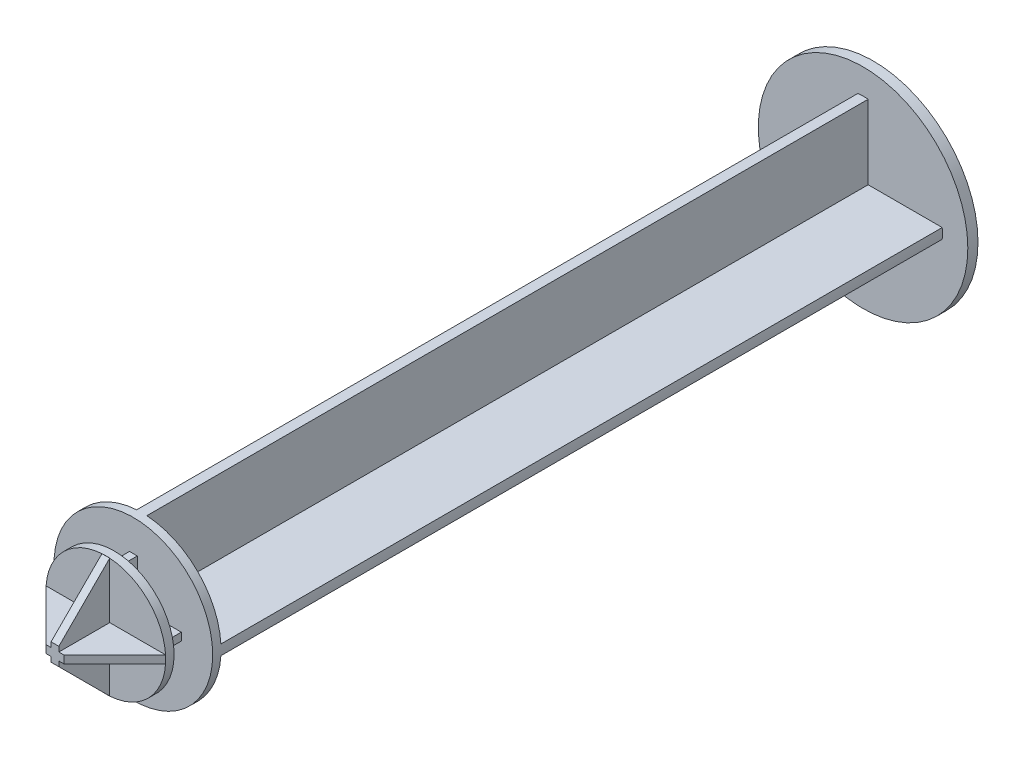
ISO-10303-21;
HEADER;
FILE_DESCRIPTION(('STEP AP214'),'2;1');
FILE_NAME('part.step','',(''),(''),'','','');
FILE_SCHEMA(('AUTOMOTIVE_DESIGN { 1 0 10303 214 1 1 1 1 }'));
ENDSEC;
DATA;
#1=APPLICATION_CONTEXT('core data for automotive mechanical design processes');
#2=APPLICATION_PROTOCOL_DEFINITION('international standard','automotive_design',2000,#1);
#3=PRODUCT_CONTEXT('',#1,'mechanical');
#4=PRODUCT('Part','Part','',(#3));
#5=PRODUCT_RELATED_PRODUCT_CATEGORY('part','',(#4));
#6=PRODUCT_DEFINITION_FORMATION('','',#4);
#7=PRODUCT_DEFINITION_CONTEXT('part definition',#1,'design');
#8=PRODUCT_DEFINITION('design','',#6,#7);
#9=PRODUCT_DEFINITION_SHAPE('','',#8);
#10=(LENGTH_UNIT() NAMED_UNIT(*) SI_UNIT(.MILLI.,.METRE.));
#11=(NAMED_UNIT(*) PLANE_ANGLE_UNIT() SI_UNIT($,.RADIAN.));
#12=(NAMED_UNIT(*) SI_UNIT($,.STERADIAN.) SOLID_ANGLE_UNIT());
#13=UNCERTAINTY_MEASURE_WITH_UNIT(LENGTH_MEASURE(1.E-05),#10,'distance_accuracy_value','');
#14=(GEOMETRIC_REPRESENTATION_CONTEXT(3) GLOBAL_UNCERTAINTY_ASSIGNED_CONTEXT((#13)) GLOBAL_UNIT_ASSIGNED_CONTEXT((#10,
#11,#12)) REPRESENTATION_CONTEXT('',''));
#15=CARTESIAN_POINT('',(0.,0.,0.));
#16=DIRECTION('',(0.,0.,1.));
#17=DIRECTION('',(1.,0.,0.));
#18=AXIS2_PLACEMENT_3D('',#15,#16,#17);
#19=CARTESIAN_POINT('',(0.,0.,128.2));
#20=DIRECTION('',(0.,0.,1.));
#21=DIRECTION('',(1.,0.,0.));
#22=AXIS2_PLACEMENT_3D('',#19,#20,#21);
#23=PLANE('',#22);
#24=DIRECTION('',(-1.,0.,0.));
#25=VECTOR('',#24,1.);
#26=CARTESIAN_POINT('',(-0.649999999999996,0.650000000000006,128.2));
#27=LINE('',#26,#25);
#28=CARTESIAN_POINT('',(-0.649999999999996,0.650000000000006,128.2));
#29=VERTEX_POINT('',#28);
#30=CARTESIAN_POINT('',(-9.9788526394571,0.649999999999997,128.2));
#31=VERTEX_POINT('',#30);
#32=EDGE_CURVE('E54',#29,#31,#27,.T.);
#33=ORIENTED_EDGE('',*,*,#32,.F.);
#34=DIRECTION('',(0.,-1.,0.));
#35=VECTOR('',#34,1.);
#36=CARTESIAN_POINT('',(-0.649999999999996,9.9788526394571,128.2));
#37=LINE('',#36,#35);
#38=CARTESIAN_POINT('',(-0.650000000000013,9.97885263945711,128.2));
#39=VERTEX_POINT('',#38);
#40=EDGE_CURVE('E477',#39,#29,#37,.T.);
#41=ORIENTED_EDGE('',*,*,#40,.F.);
#42=CARTESIAN_POINT('',(0.,0.,128.2));
#43=DIRECTION('',(0.,0.,1.));
#44=DIRECTION('',(1.,0.,0.));
#45=AXIS2_PLACEMENT_3D('',#42,#43,#44);
#46=CIRCLE('',#45,10.);
#47=EDGE_CURVE('E536',#39,#31,#46,.T.);
#48=ORIENTED_EDGE('',*,*,#47,.T.);
#49=EDGE_LOOP('',(#33,#41,#48));
#50=FACE_BOUND('',#49,.T.);
#51=ADVANCED_FACE('F35',(#50),#23,.T.);
#52=DIRECTION('',(1.,0.,0.));
#53=VECTOR('',#52,1.);
#54=CARTESIAN_POINT('',(0.,9.9788526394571,128.2));
#55=LINE('',#54,#53);
#56=CARTESIAN_POINT('',(0.650000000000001,9.9788526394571,128.2));
#57=VERTEX_POINT('',#56);
#58=EDGE_CURVE('E475',#57,#39,#55,.F.);
#59=ORIENTED_EDGE('',*,*,#58,.F.);
#60=EDGE_CURVE('E315',#57,#39,#46,.T.);
#61=ORIENTED_EDGE('',*,*,#60,.T.);
#62=EDGE_LOOP('',(#59,#61));
#63=FACE_BOUND('',#62,.T.);
#64=ADVANCED_FACE('F549',(#63),#23,.T.);
#65=DIRECTION('',(0.,1.,0.));
#66=VECTOR('',#65,1.);
#67=CARTESIAN_POINT('',(0.650000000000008,0.650000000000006,128.2));
#68=LINE('',#67,#66);
#69=CARTESIAN_POINT('',(0.650000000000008,0.650000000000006,128.2));
#70=VERTEX_POINT('',#69);
#71=EDGE_CURVE('E472',#70,#57,#68,.T.);
#72=ORIENTED_EDGE('',*,*,#71,.F.);
#73=DIRECTION('',(-1.,0.,0.));
#74=VECTOR('',#73,1.);
#75=CARTESIAN_POINT('',(9.9788526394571,0.649999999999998,128.2));
#76=LINE('',#75,#74);
#77=CARTESIAN_POINT('',(9.97885263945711,0.649999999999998,128.2));
#78=VERTEX_POINT('',#77);
#79=EDGE_CURVE('E476',#78,#70,#76,.T.);
#80=ORIENTED_EDGE('',*,*,#79,.F.);
#81=EDGE_CURVE('E363',#78,#57,#46,.T.);
#82=ORIENTED_EDGE('',*,*,#81,.T.);
#83=EDGE_LOOP('',(#72,#80,#82));
#84=FACE_BOUND('',#83,.T.);
#85=ADVANCED_FACE('F559',(#84),#23,.T.);
#86=DIRECTION('',(0.,-1.,0.));
#87=VECTOR('',#86,1.);
#88=CARTESIAN_POINT('',(9.9788526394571,0.,128.2));
#89=LINE('',#88,#87);
#90=CARTESIAN_POINT('',(9.9788526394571,-0.649999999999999,128.2));
#91=VERTEX_POINT('',#90);
#92=EDGE_CURVE('E283',#91,#78,#89,.F.);
#93=ORIENTED_EDGE('',*,*,#92,.F.);
#94=EDGE_CURVE('E319',#91,#78,#46,.T.);
#95=ORIENTED_EDGE('',*,*,#94,.T.);
#96=EDGE_LOOP('',(#93,#95));
#97=FACE_BOUND('',#96,.T.);
#98=ADVANCED_FACE('F570',(#97),#23,.T.);
#99=DIRECTION('',(1.,0.,0.));
#100=VECTOR('',#99,1.);
#101=CARTESIAN_POINT('',(0.649999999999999,-0.650000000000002,128.2));
#102=LINE('',#101,#100);
#103=CARTESIAN_POINT('',(0.649999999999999,-0.650000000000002,128.2));
#104=VERTEX_POINT('',#103);
#105=EDGE_CURVE('E273',#104,#91,#102,.T.);
#106=ORIENTED_EDGE('',*,*,#105,.F.);
#107=DIRECTION('',(0.,1.,0.));
#108=VECTOR('',#107,1.);
#109=CARTESIAN_POINT('',(0.650000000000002,-9.9788526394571,128.2));
#110=LINE('',#109,#108);
#111=CARTESIAN_POINT('',(0.65,-9.97885263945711,128.2));
#112=VERTEX_POINT('',#111);
#113=EDGE_CURVE('E276',#112,#104,#110,.T.);
#114=ORIENTED_EDGE('',*,*,#113,.F.);
#115=EDGE_CURVE('E278',#112,#91,#46,.T.);
#116=ORIENTED_EDGE('',*,*,#115,.T.);
#117=EDGE_LOOP('',(#106,#114,#116));
#118=FACE_BOUND('',#117,.T.);
#119=ADVANCED_FACE('F275',(#118),#23,.T.);
#120=DIRECTION('',(-1.,0.,0.));
#121=VECTOR('',#120,1.);
#122=CARTESIAN_POINT('',(0.,-9.9788526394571,128.2));
#123=LINE('',#122,#121);
#124=CARTESIAN_POINT('',(-0.649999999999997,-9.9788526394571,128.2));
#125=VERTEX_POINT('',#124);
#126=EDGE_CURVE('E294',#125,#112,#123,.F.);
#127=ORIENTED_EDGE('',*,*,#126,.F.);
#128=EDGE_CURVE('E311',#125,#112,#46,.T.);
#129=ORIENTED_EDGE('',*,*,#128,.T.);
#130=EDGE_LOOP('',(#127,#129));
#131=FACE_BOUND('',#130,.T.);
#132=ADVANCED_FACE('F574',(#131),#23,.T.);
#133=DIRECTION('',(0.,-1.,0.));
#134=VECTOR('',#133,1.);
#135=CARTESIAN_POINT('',(-0.649999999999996,-0.650000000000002,128.2));
#136=LINE('',#135,#134);
#137=CARTESIAN_POINT('',(-0.649999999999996,-0.650000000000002,128.2));
#138=VERTEX_POINT('',#137);
#139=EDGE_CURVE('E468',#138,#125,#136,.T.);
#140=ORIENTED_EDGE('',*,*,#139,.F.);
#141=DIRECTION('',(1.,0.,0.));
#142=VECTOR('',#141,1.);
#143=CARTESIAN_POINT('',(-9.9788526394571,-0.650000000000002,128.2));
#144=LINE('',#143,#142);
#145=CARTESIAN_POINT('',(-9.97885263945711,-0.65,128.2));
#146=VERTEX_POINT('',#145);
#147=EDGE_CURVE('E470',#146,#138,#144,.T.);
#148=ORIENTED_EDGE('',*,*,#147,.F.);
#149=EDGE_CURVE('E314',#146,#125,#46,.T.);
#150=ORIENTED_EDGE('',*,*,#149,.T.);
#151=EDGE_LOOP('',(#140,#148,#150));
#152=FACE_BOUND('',#151,.T.);
#153=ADVANCED_FACE('F584',(#152),#23,.T.);
#154=CARTESIAN_POINT('',(0.,0.,123.6));
#155=DIRECTION('',(0.,0.,1.));
#156=DIRECTION('',(1.,0.,0.));
#157=AXIS2_PLACEMENT_3D('',#154,#155,#156);
#158=PLANE('',#157);
#159=CARTESIAN_POINT('',(0.,0.,123.6));
#160=DIRECTION('',(0.,0.,1.));
#161=DIRECTION('',(1.,0.,0.));
#162=AXIS2_PLACEMENT_3D('',#159,#160,#161);
#163=CIRCLE('',#162,13.25);
#164=CARTESIAN_POINT('',(13.25,0.,123.6));
#165=VERTEX_POINT('',#164);
#166=EDGE_CURVE('E419',#165,#165,#163,.T.);
#167=ORIENTED_EDGE('',*,*,#166,.T.);
#168=EDGE_LOOP('',(#167));
#169=FACE_BOUND('',#168,.T.);
#170=DIRECTION('',(1.,0.,0.));
#171=VECTOR('',#170,1.);
#172=CARTESIAN_POINT('',(-8.,-0.650000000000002,123.6));
#173=LINE('',#172,#171);
#174=CARTESIAN_POINT('',(-8.,-0.650000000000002,123.6));
#175=VERTEX_POINT('',#174);
#176=CARTESIAN_POINT('',(-0.649999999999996,-0.650000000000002,123.6));
#177=VERTEX_POINT('',#176);
#178=EDGE_CURVE('E362',#175,#177,#173,.T.);
#179=ORIENTED_EDGE('',*,*,#178,.F.);
#180=DIRECTION('',(0.,-1.,0.));
#181=VECTOR('',#180,1.);
#182=CARTESIAN_POINT('',(-8.,0.649999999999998,123.6));
#183=LINE('',#182,#181);
#184=CARTESIAN_POINT('',(-8.,0.649999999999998,123.6));
#185=VERTEX_POINT('',#184);
#186=EDGE_CURVE('E359',#185,#175,#183,.T.);
#187=ORIENTED_EDGE('',*,*,#186,.F.);
#188=DIRECTION('',(-1.,0.,0.));
#189=VECTOR('',#188,1.);
#190=CARTESIAN_POINT('',(-8.,0.649999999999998,123.6));
#191=LINE('',#190,#189);
#192=CARTESIAN_POINT('',(-0.649999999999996,0.650000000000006,123.6));
#193=VERTEX_POINT('',#192);
#194=EDGE_CURVE('E325',#193,#185,#191,.T.);
#195=ORIENTED_EDGE('',*,*,#194,.F.);
#196=DIRECTION('',(0.,-1.,0.));
#197=VECTOR('',#196,1.);
#198=CARTESIAN_POINT('',(-0.649999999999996,8.,123.6));
#199=LINE('',#198,#197);
#200=CARTESIAN_POINT('',(-0.649999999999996,8.,123.6));
#201=VERTEX_POINT('',#200);
#202=EDGE_CURVE('E381',#201,#193,#199,.T.);
#203=ORIENTED_EDGE('',*,*,#202,.F.);
#204=DIRECTION('',(-1.,0.,0.));
#205=VECTOR('',#204,1.);
#206=CARTESIAN_POINT('',(-0.649999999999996,8.,123.6));
#207=LINE('',#206,#205);
#208=CARTESIAN_POINT('',(0.650000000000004,8.,123.6));
#209=VERTEX_POINT('',#208);
#210=EDGE_CURVE('E379',#209,#201,#207,.T.);
#211=ORIENTED_EDGE('',*,*,#210,.F.);
#212=DIRECTION('',(0.,1.,0.));
#213=VECTOR('',#212,1.);
#214=CARTESIAN_POINT('',(0.650000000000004,8.,123.6));
#215=LINE('',#214,#213);
#216=CARTESIAN_POINT('',(0.650000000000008,0.650000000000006,123.6));
#217=VERTEX_POINT('',#216);
#218=EDGE_CURVE('E377',#217,#209,#215,.T.);
#219=ORIENTED_EDGE('',*,*,#218,.F.);
#220=DIRECTION('',(-1.,0.,0.));
#221=VECTOR('',#220,1.);
#222=CARTESIAN_POINT('',(0.650000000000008,0.650000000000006,123.6));
#223=LINE('',#222,#221);
#224=CARTESIAN_POINT('',(8.,0.65,123.6));
#225=VERTEX_POINT('',#224);
#226=EDGE_CURVE('E375',#225,#217,#223,.T.);
#227=ORIENTED_EDGE('',*,*,#226,.F.);
#228=DIRECTION('',(0.,1.,0.));
#229=VECTOR('',#228,1.);
#230=CARTESIAN_POINT('',(8.,0.65,123.6));
#231=LINE('',#230,#229);
#232=CARTESIAN_POINT('',(8.,-0.65,123.6));
#233=VERTEX_POINT('',#232);
#234=EDGE_CURVE('E373',#233,#225,#231,.T.);
#235=ORIENTED_EDGE('',*,*,#234,.F.);
#236=DIRECTION('',(1.,0.,0.));
#237=VECTOR('',#236,1.);
#238=CARTESIAN_POINT('',(0.649999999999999,-0.650000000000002,123.6));
#239=LINE('',#238,#237);
#240=CARTESIAN_POINT('',(0.649999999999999,-0.650000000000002,123.6));
#241=VERTEX_POINT('',#240);
#242=EDGE_CURVE('E371',#241,#233,#239,.T.);
#243=ORIENTED_EDGE('',*,*,#242,.F.);
#244=DIRECTION('',(0.,1.,0.));
#245=VECTOR('',#244,1.);
#246=CARTESIAN_POINT('',(0.649999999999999,-0.650000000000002,123.6));
#247=LINE('',#246,#245);
#248=CARTESIAN_POINT('',(0.650000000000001,-8.,123.6));
#249=VERTEX_POINT('',#248);
#250=EDGE_CURVE('E369',#249,#241,#247,.T.);
#251=ORIENTED_EDGE('',*,*,#250,.F.);
#252=DIRECTION('',(1.,0.,0.));
#253=VECTOR('',#252,1.);
#254=CARTESIAN_POINT('',(-0.649999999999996,-8.,123.6));
#255=LINE('',#254,#253);
#256=CARTESIAN_POINT('',(-0.649999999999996,-8.,123.6));
#257=VERTEX_POINT('',#256);
#258=EDGE_CURVE('E367',#257,#249,#255,.T.);
#259=ORIENTED_EDGE('',*,*,#258,.F.);
#260=DIRECTION('',(0.,-1.,0.));
#261=VECTOR('',#260,1.);
#262=CARTESIAN_POINT('',(-0.649999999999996,-0.650000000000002,123.6));
#263=LINE('',#262,#261);
#264=EDGE_CURVE('E365',#177,#257,#263,.T.);
#265=ORIENTED_EDGE('',*,*,#264,.F.);
#266=EDGE_LOOP('',(#179,#187,#195,#203,#211,#219,#227,#235,#243,#251,#259,#265));
#267=FACE_BOUND('',#266,.T.);
#268=ADVANCED_FACE('F604',(#169,#267),#158,.T.);
#269=CARTESIAN_POINT('',(0.,0.,1.7));
#270=DIRECTION('',(0.,0.,1.));
#271=DIRECTION('',(1.,0.,0.));
#272=AXIS2_PLACEMENT_3D('',#269,#270,#271);
#273=PLANE('',#272);
#274=CARTESIAN_POINT('',(0.,0.,1.7));
#275=DIRECTION('',(0.,0.,1.));
#276=DIRECTION('',(1.,0.,0.));
#277=AXIS2_PLACEMENT_3D('',#274,#275,#276);
#278=CIRCLE('',#277,17.5);
#279=CARTESIAN_POINT('',(17.5,0.,1.7));
#280=VERTEX_POINT('',#279);
#281=EDGE_CURVE('E11',#280,#280,#278,.T.);
#282=ORIENTED_EDGE('',*,*,#281,.T.);
#283=EDGE_LOOP('',(#282));
#284=FACE_BOUND('',#283,.T.);
#285=DIRECTION('',(0.,1.,0.));
#286=VECTOR('',#285,1.);
#287=CARTESIAN_POINT('',(0.850000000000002,-0.85,1.7));
#288=LINE('',#287,#286);
#289=CARTESIAN_POINT('',(0.849999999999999,-13.2227077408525,1.7));
#290=VERTEX_POINT('',#289);
#291=CARTESIAN_POINT('',(0.850000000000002,-0.85,1.7));
#292=VERTEX_POINT('',#291);
#293=EDGE_CURVE('E1090',#290,#292,#288,.T.);
#294=ORIENTED_EDGE('',*,*,#293,.F.);
#295=CARTESIAN_POINT('',(0.,0.,1.7));
#296=DIRECTION('',(0.,0.,1.));
#297=DIRECTION('',(1.,0.,0.));
#298=AXIS2_PLACEMENT_3D('',#295,#296,#297);
#299=CIRCLE('',#298,13.25);
#300=CARTESIAN_POINT('',(-0.849999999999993,-13.2227077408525,1.7));
#301=VERTEX_POINT('',#300);
#302=EDGE_CURVE('E422',#301,#290,#299,.T.);
#303=ORIENTED_EDGE('',*,*,#302,.F.);
#304=DIRECTION('',(0.,-1.,0.));
#305=VECTOR('',#304,1.);
#306=CARTESIAN_POINT('',(-0.849999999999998,-0.85,1.7));
#307=LINE('',#306,#305);
#308=CARTESIAN_POINT('',(-0.849999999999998,-0.85,1.7));
#309=VERTEX_POINT('',#308);
#310=EDGE_CURVE('E461',#309,#301,#307,.T.);
#311=ORIENTED_EDGE('',*,*,#310,.F.);
#312=DIRECTION('',(1.,0.,0.));
#313=VECTOR('',#312,1.);
#314=CARTESIAN_POINT('',(-13.2227077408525,-0.85,1.7));
#315=LINE('',#314,#313);
#316=CARTESIAN_POINT('',(-13.2227077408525,-0.85,1.7));
#317=VERTEX_POINT('',#316);
#318=EDGE_CURVE('E1108',#317,#309,#315,.T.);
#319=ORIENTED_EDGE('',*,*,#318,.F.);
#320=CARTESIAN_POINT('',(0.,0.,1.7));
#321=DIRECTION('',(0.,0.,1.));
#322=DIRECTION('',(1.,0.,0.));
#323=AXIS2_PLACEMENT_3D('',#320,#321,#322);
#324=CIRCLE('',#323,13.25);
#325=CARTESIAN_POINT('',(-13.2227077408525,0.849999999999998,1.7));
#326=VERTEX_POINT('',#325);
#327=EDGE_CURVE('E1106',#326,#317,#324,.T.);
#328=ORIENTED_EDGE('',*,*,#327,.F.);
#329=DIRECTION('',(-1.,0.,0.));
#330=VECTOR('',#329,1.);
#331=CARTESIAN_POINT('',(-13.2227077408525,0.85,1.7));
#332=LINE('',#331,#330);
#333=CARTESIAN_POINT('',(-0.849999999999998,0.85,1.7));
#334=VERTEX_POINT('',#333);
#335=EDGE_CURVE('E1104',#334,#326,#332,.T.);
#336=ORIENTED_EDGE('',*,*,#335,.F.);
#337=DIRECTION('',(0.,-1.,0.));
#338=VECTOR('',#337,1.);
#339=CARTESIAN_POINT('',(-0.849999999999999,13.2227077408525,1.7));
#340=LINE('',#339,#338);
#341=CARTESIAN_POINT('',(-0.849999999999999,13.2227077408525,1.7));
#342=VERTEX_POINT('',#341);
#343=EDGE_CURVE('E1102',#342,#334,#340,.T.);
#344=ORIENTED_EDGE('',*,*,#343,.F.);
#345=CARTESIAN_POINT('',(0.,0.,1.7));
#346=DIRECTION('',(0.,0.,1.));
#347=DIRECTION('',(1.,0.,0.));
#348=AXIS2_PLACEMENT_3D('',#345,#346,#347);
#349=CIRCLE('',#348,13.25);
#350=CARTESIAN_POINT('',(0.850000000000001,13.2227077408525,1.7));
#351=VERTEX_POINT('',#350);
#352=EDGE_CURVE('E1100',#351,#342,#349,.T.);
#353=ORIENTED_EDGE('',*,*,#352,.F.);
#354=DIRECTION('',(0.,1.,0.));
#355=VECTOR('',#354,1.);
#356=CARTESIAN_POINT('',(0.849999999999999,13.2227077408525,1.7));
#357=LINE('',#356,#355);
#358=CARTESIAN_POINT('',(0.850000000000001,0.850000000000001,1.7));
#359=VERTEX_POINT('',#358);
#360=EDGE_CURVE('E1098',#359,#351,#357,.T.);
#361=ORIENTED_EDGE('',*,*,#360,.F.);
#362=DIRECTION('',(-1.,0.,0.));
#363=VECTOR('',#362,1.);
#364=CARTESIAN_POINT('',(0.850000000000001,0.850000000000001,1.7));
#365=LINE('',#364,#363);
#366=CARTESIAN_POINT('',(13.2227077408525,0.849999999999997,1.7));
#367=VERTEX_POINT('',#366);
#368=EDGE_CURVE('E1096',#367,#359,#365,.T.);
#369=ORIENTED_EDGE('',*,*,#368,.F.);
#370=CARTESIAN_POINT('',(0.,0.,1.7));
#371=DIRECTION('',(0.,0.,1.));
#372=DIRECTION('',(1.,0.,0.));
#373=AXIS2_PLACEMENT_3D('',#370,#371,#372);
#374=CIRCLE('',#373,13.25);
#375=CARTESIAN_POINT('',(13.2227077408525,-0.85,1.7));
#376=VERTEX_POINT('',#375);
#377=EDGE_CURVE('E1094',#376,#367,#374,.T.);
#378=ORIENTED_EDGE('',*,*,#377,.F.);
#379=DIRECTION('',(1.,0.,0.));
#380=VECTOR('',#379,1.);
#381=CARTESIAN_POINT('',(0.850000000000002,-0.85,1.7));
#382=LINE('',#381,#380);
#383=EDGE_CURVE('E1092',#292,#376,#382,.T.);
#384=ORIENTED_EDGE('',*,*,#383,.F.);
#385=EDGE_LOOP('',(#294,#303,#311,#319,#328,#336,#344,#353,#361,#369,#378,#384));
#386=FACE_BOUND('',#385,.T.);
#387=ADVANCED_FACE('F609',(#284,#386),#273,.T.);
#388=CARTESIAN_POINT('',(0.,0.,1.7));
#389=DIRECTION('',(0.,0.,-1.));
#390=DIRECTION('',(-1.,0.,0.));
#391=AXIS2_PLACEMENT_3D('',#388,#389,#390);
#392=CYLINDRICAL_SURFACE('',#391,17.5);
#393=ORIENTED_EDGE('',*,*,#281,.F.);
#394=EDGE_LOOP('',(#393));
#395=FACE_BOUND('',#394,.T.);
#396=CARTESIAN_POINT('',(0.,0.,0.));
#397=DIRECTION('',(0.,0.,1.));
#398=DIRECTION('',(1.,0.,0.));
#399=AXIS2_PLACEMENT_3D('',#396,#397,#398);
#400=CIRCLE('',#399,17.5);
#401=CARTESIAN_POINT('',(17.5,0.,0.));
#402=VERTEX_POINT('',#401);
#403=EDGE_CURVE('E45',#402,#402,#400,.T.);
#404=ORIENTED_EDGE('',*,*,#403,.T.);
#405=EDGE_LOOP('',(#404));
#406=FACE_BOUND('',#405,.T.);
#407=ADVANCED_FACE('F907',(#395,#406),#392,.T.);
#408=CARTESIAN_POINT('',(0.,0.,0.));
#409=DIRECTION('',(0.,0.,1.));
#410=DIRECTION('',(1.,0.,0.));
#411=AXIS2_PLACEMENT_3D('',#408,#409,#410);
#412=PLANE('',#411);
#413=ORIENTED_EDGE('',*,*,#403,.F.);
#414=EDGE_LOOP('',(#413));
#415=FACE_BOUND('',#414,.T.);
#416=ADVANCED_FACE('F896',(#415),#412,.F.);
#417=CARTESIAN_POINT('',(0.,0.,122.2));
#418=DIRECTION('',(0.,0.,-1.));
#419=DIRECTION('',(-1.,0.,0.));
#420=AXIS2_PLACEMENT_3D('',#417,#418,#419);
#421=CYLINDRICAL_SURFACE('',#420,13.25);
#422=ORIENTED_EDGE('',*,*,#302,.T.);
#423=DIRECTION('',(0.,0.,-1.));
#424=VECTOR('',#423,1.);
#425=CARTESIAN_POINT('',(0.849999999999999,-13.2227077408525,122.2));
#426=LINE('',#425,#424);
#427=CARTESIAN_POINT('',(0.849999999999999,-13.2227077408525,122.2));
#428=VERTEX_POINT('',#427);
#429=EDGE_CURVE('E464',#428,#290,#426,.T.);
#430=ORIENTED_EDGE('',*,*,#429,.F.);
#431=CARTESIAN_POINT('',(0.,0.,122.2));
#432=DIRECTION('',(0.,0.,1.));
#433=DIRECTION('',(1.,0.,0.));
#434=AXIS2_PLACEMENT_3D('',#431,#432,#433);
#435=CIRCLE('',#434,13.25);
#436=CARTESIAN_POINT('',(13.2227077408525,-0.85,122.2));
#437=VERTEX_POINT('',#436);
#438=EDGE_CURVE('E418',#428,#437,#435,.T.);
#439=ORIENTED_EDGE('',*,*,#438,.T.);
#440=DIRECTION('',(0.,0.,-1.));
#441=VECTOR('',#440,1.);
#442=CARTESIAN_POINT('',(13.2227077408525,-0.85,122.2));
#443=LINE('',#442,#441);
#444=EDGE_CURVE('E452',#437,#376,#443,.T.);
#445=ORIENTED_EDGE('',*,*,#444,.T.);
#446=ORIENTED_EDGE('',*,*,#377,.T.);
#447=DIRECTION('',(0.,0.,-1.));
#448=VECTOR('',#447,1.);
#449=CARTESIAN_POINT('',(13.2227077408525,0.849999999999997,122.2));
#450=LINE('',#449,#448);
#451=CARTESIAN_POINT('',(13.2227077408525,0.849999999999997,122.2));
#452=VERTEX_POINT('',#451);
#453=EDGE_CURVE('E456',#452,#367,#450,.T.);
#454=ORIENTED_EDGE('',*,*,#453,.F.);
#455=CARTESIAN_POINT('',(0.850000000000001,13.2227077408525,122.2));
#456=VERTEX_POINT('',#455);
#457=EDGE_CURVE('E423',#452,#456,#435,.T.);
#458=ORIENTED_EDGE('',*,*,#457,.T.);
#459=DIRECTION('',(0.,0.,-1.));
#460=VECTOR('',#459,1.);
#461=CARTESIAN_POINT('',(0.850000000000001,13.2227077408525,122.2));
#462=LINE('',#461,#460);
#463=EDGE_CURVE('E1120',#456,#351,#462,.T.);
#464=ORIENTED_EDGE('',*,*,#463,.T.);
#465=ORIENTED_EDGE('',*,*,#352,.T.);
#466=DIRECTION('',(0.,0.,-1.));
#467=VECTOR('',#466,1.);
#468=CARTESIAN_POINT('',(-0.849999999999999,13.2227077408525,122.2));
#469=LINE('',#468,#467);
#470=CARTESIAN_POINT('',(-0.849999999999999,13.2227077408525,122.2));
#471=VERTEX_POINT('',#470);
#472=EDGE_CURVE('E1116',#471,#342,#469,.T.);
#473=ORIENTED_EDGE('',*,*,#472,.F.);
#474=CARTESIAN_POINT('',(-13.2227077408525,0.849999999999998,122.2));
#475=VERTEX_POINT('',#474);
#476=EDGE_CURVE('E427',#471,#475,#435,.T.);
#477=ORIENTED_EDGE('',*,*,#476,.T.);
#478=DIRECTION('',(0.,0.,-1.));
#479=VECTOR('',#478,1.);
#480=CARTESIAN_POINT('',(-13.2227077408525,0.849999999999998,122.2));
#481=LINE('',#480,#479);
#482=EDGE_CURVE('E1117',#475,#326,#481,.T.);
#483=ORIENTED_EDGE('',*,*,#482,.T.);
#484=ORIENTED_EDGE('',*,*,#327,.T.);
#485=DIRECTION('',(0.,0.,-1.));
#486=VECTOR('',#485,1.);
#487=CARTESIAN_POINT('',(-13.2227077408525,-0.85,122.2));
#488=LINE('',#487,#486);
#489=CARTESIAN_POINT('',(-13.2227077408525,-0.85,122.2));
#490=VERTEX_POINT('',#489);
#491=EDGE_CURVE('E1083',#490,#317,#488,.T.);
#492=ORIENTED_EDGE('',*,*,#491,.F.);
#493=CARTESIAN_POINT('',(-0.849999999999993,-13.2227077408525,122.2));
#494=VERTEX_POINT('',#493);
#495=EDGE_CURVE('E435',#490,#494,#435,.T.);
#496=ORIENTED_EDGE('',*,*,#495,.T.);
#497=DIRECTION('',(0.,0.,-1.));
#498=VECTOR('',#497,1.);
#499=CARTESIAN_POINT('',(-0.849999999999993,-13.2227077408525,122.2));
#500=LINE('',#499,#498);
#501=EDGE_CURVE('E1072',#494,#301,#500,.T.);
#502=ORIENTED_EDGE('',*,*,#501,.T.);
#503=EDGE_LOOP('',(#422,#430,#439,#445,#446,#454,#458,#464,#465,#473,#477,#483,#484,#492,#496,#502));
#504=FACE_BOUND('',#503,.T.);
#505=ORIENTED_EDGE('',*,*,#166,.F.);
#506=EDGE_LOOP('',(#505));
#507=FACE_BOUND('',#506,.T.);
#508=ADVANCED_FACE('F886',(#504,#507),#421,.T.);
#509=CARTESIAN_POINT('',(0.850000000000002,-0.85,122.2));
#510=DIRECTION('',(-1.,0.,0.));
#511=DIRECTION('',(0.,-1.,0.));
#512=AXIS2_PLACEMENT_3D('',#509,#510,#511);
#513=PLANE('',#512);
#514=ORIENTED_EDGE('',*,*,#293,.T.);
#515=DIRECTION('',(0.,0.,-1.));
#516=VECTOR('',#515,1.);
#517=CARTESIAN_POINT('',(0.850000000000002,-0.85,122.2));
#518=LINE('',#517,#516);
#519=CARTESIAN_POINT('',(0.850000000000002,-0.85,122.2));
#520=VERTEX_POINT('',#519);
#521=EDGE_CURVE('E455',#520,#292,#518,.T.);
#522=ORIENTED_EDGE('',*,*,#521,.F.);
#523=DIRECTION('',(0.,1.,0.));
#524=VECTOR('',#523,1.);
#525=CARTESIAN_POINT('',(0.850000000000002,-0.85,122.2));
#526=LINE('',#525,#524);
#527=EDGE_CURVE('E449',#428,#520,#526,.T.);
#528=ORIENTED_EDGE('',*,*,#527,.F.);
#529=ORIENTED_EDGE('',*,*,#429,.T.);
#530=EDGE_LOOP('',(#514,#522,#528,#529));
#531=FACE_BOUND('',#530,.T.);
#532=ADVANCED_FACE('F876',(#531),#513,.F.);
#533=CARTESIAN_POINT('',(0.850000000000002,-0.85,122.2));
#534=DIRECTION('',(0.,1.,0.));
#535=DIRECTION('',(-1.,0.,0.));
#536=AXIS2_PLACEMENT_3D('',#533,#534,#535);
#537=PLANE('',#536);
#538=ORIENTED_EDGE('',*,*,#383,.T.);
#539=ORIENTED_EDGE('',*,*,#444,.F.);
#540=DIRECTION('',(1.,0.,0.));
#541=VECTOR('',#540,1.);
#542=CARTESIAN_POINT('',(0.850000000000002,-0.85,122.2));
#543=LINE('',#542,#541);
#544=EDGE_CURVE('E444',#520,#437,#543,.T.);
#545=ORIENTED_EDGE('',*,*,#544,.F.);
#546=ORIENTED_EDGE('',*,*,#521,.T.);
#547=EDGE_LOOP('',(#538,#539,#545,#546));
#548=FACE_BOUND('',#547,.T.);
#549=ADVANCED_FACE('F866',(#548),#537,.F.);
#550=CARTESIAN_POINT('',(0.850000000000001,0.850000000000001,122.2));
#551=DIRECTION('',(0.,-1.,0.));
#552=DIRECTION('',(1.,0.,0.));
#553=AXIS2_PLACEMENT_3D('',#550,#551,#552);
#554=PLANE('',#553);
#555=ORIENTED_EDGE('',*,*,#368,.T.);
#556=DIRECTION('',(0.,0.,-1.));
#557=VECTOR('',#556,1.);
#558=CARTESIAN_POINT('',(0.850000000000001,0.850000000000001,122.2));
#559=LINE('',#558,#557);
#560=CARTESIAN_POINT('',(0.850000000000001,0.850000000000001,122.2));
#561=VERTEX_POINT('',#560);
#562=EDGE_CURVE('E1118',#561,#359,#559,.T.);
#563=ORIENTED_EDGE('',*,*,#562,.F.);
#564=DIRECTION('',(-1.,0.,0.));
#565=VECTOR('',#564,1.);
#566=CARTESIAN_POINT('',(0.850000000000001,0.850000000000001,122.2));
#567=LINE('',#566,#565);
#568=EDGE_CURVE('E448',#452,#561,#567,.T.);
#569=ORIENTED_EDGE('',*,*,#568,.F.);
#570=ORIENTED_EDGE('',*,*,#453,.T.);
#571=EDGE_LOOP('',(#555,#563,#569,#570));
#572=FACE_BOUND('',#571,.T.);
#573=ADVANCED_FACE('F856',(#572),#554,.F.);
#574=CARTESIAN_POINT('',(0.849999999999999,13.2227077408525,122.2));
#575=DIRECTION('',(-1.,0.,0.));
#576=DIRECTION('',(0.,-1.,0.));
#577=AXIS2_PLACEMENT_3D('',#574,#575,#576);
#578=PLANE('',#577);
#579=ORIENTED_EDGE('',*,*,#360,.T.);
#580=ORIENTED_EDGE('',*,*,#463,.F.);
#581=DIRECTION('',(0.,1.,0.));
#582=VECTOR('',#581,1.);
#583=CARTESIAN_POINT('',(0.849999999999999,13.2227077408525,122.2));
#584=LINE('',#583,#582);
#585=EDGE_CURVE('E1141',#561,#456,#584,.T.);
#586=ORIENTED_EDGE('',*,*,#585,.F.);
#587=ORIENTED_EDGE('',*,*,#562,.T.);
#588=EDGE_LOOP('',(#579,#580,#586,#587));
#589=FACE_BOUND('',#588,.T.);
#590=ADVANCED_FACE('F846',(#589),#578,.F.);
#591=CARTESIAN_POINT('',(-0.849999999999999,13.2227077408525,122.2));
#592=DIRECTION('',(1.,0.,0.));
#593=DIRECTION('',(0.,1.,0.));
#594=AXIS2_PLACEMENT_3D('',#591,#592,#593);
#595=PLANE('',#594);
#596=ORIENTED_EDGE('',*,*,#343,.T.);
#597=DIRECTION('',(0.,0.,-1.));
#598=VECTOR('',#597,1.);
#599=CARTESIAN_POINT('',(-0.849999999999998,0.85,122.2));
#600=LINE('',#599,#598);
#601=CARTESIAN_POINT('',(-0.849999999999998,0.85,122.2));
#602=VERTEX_POINT('',#601);
#603=EDGE_CURVE('E1113',#602,#334,#600,.T.);
#604=ORIENTED_EDGE('',*,*,#603,.F.);
#605=DIRECTION('',(0.,-1.,0.));
#606=VECTOR('',#605,1.);
#607=CARTESIAN_POINT('',(-0.849999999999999,13.2227077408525,122.2));
#608=LINE('',#607,#606);
#609=EDGE_CURVE('E1143',#471,#602,#608,.T.);
#610=ORIENTED_EDGE('',*,*,#609,.F.);
#611=ORIENTED_EDGE('',*,*,#472,.T.);
#612=EDGE_LOOP('',(#596,#604,#610,#611));
#613=FACE_BOUND('',#612,.T.);
#614=ADVANCED_FACE('F836',(#613),#595,.F.);
#615=CARTESIAN_POINT('',(-13.2227077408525,0.85,122.2));
#616=DIRECTION('',(0.,-1.,0.));
#617=DIRECTION('',(0.,0.,-1.));
#618=AXIS2_PLACEMENT_3D('',#615,#616,#617);
#619=PLANE('',#618);
#620=ORIENTED_EDGE('',*,*,#335,.T.);
#621=ORIENTED_EDGE('',*,*,#482,.F.);
#622=DIRECTION('',(-1.,0.,0.));
#623=VECTOR('',#622,1.);
#624=CARTESIAN_POINT('',(-13.2227077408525,0.85,122.2));
#625=LINE('',#624,#623);
#626=EDGE_CURVE('E1147',#602,#475,#625,.T.);
#627=ORIENTED_EDGE('',*,*,#626,.F.);
#628=ORIENTED_EDGE('',*,*,#603,.T.);
#629=EDGE_LOOP('',(#620,#621,#627,#628));
#630=FACE_BOUND('',#629,.T.);
#631=ADVANCED_FACE('F826',(#630),#619,.F.);
#632=CARTESIAN_POINT('',(-13.2227077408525,-0.85,122.2));
#633=DIRECTION('',(0.,1.,0.));
#634=DIRECTION('',(0.,0.,1.));
#635=AXIS2_PLACEMENT_3D('',#632,#633,#634);
#636=PLANE('',#635);
#637=ORIENTED_EDGE('',*,*,#318,.T.);
#638=DIRECTION('',(0.,0.,-1.));
#639=VECTOR('',#638,1.);
#640=CARTESIAN_POINT('',(-0.849999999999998,-0.85,122.2));
#641=LINE('',#640,#639);
#642=CARTESIAN_POINT('',(-0.849999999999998,-0.85,122.2));
#643=VERTEX_POINT('',#642);
#644=EDGE_CURVE('E1075',#643,#309,#641,.T.);
#645=ORIENTED_EDGE('',*,*,#644,.F.);
#646=DIRECTION('',(1.,0.,0.));
#647=VECTOR('',#646,1.);
#648=CARTESIAN_POINT('',(-13.2227077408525,-0.85,122.2));
#649=LINE('',#648,#647);
#650=EDGE_CURVE('E1082',#490,#643,#649,.T.);
#651=ORIENTED_EDGE('',*,*,#650,.F.);
#652=ORIENTED_EDGE('',*,*,#491,.T.);
#653=EDGE_LOOP('',(#637,#645,#651,#652));
#654=FACE_BOUND('',#653,.T.);
#655=ADVANCED_FACE('F815',(#654),#636,.F.);
#656=CARTESIAN_POINT('',(-0.849999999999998,-0.85,122.2));
#657=DIRECTION('',(1.,0.,0.));
#658=DIRECTION('',(0.,1.,0.));
#659=AXIS2_PLACEMENT_3D('',#656,#657,#658);
#660=PLANE('',#659);
#661=ORIENTED_EDGE('',*,*,#310,.T.);
#662=ORIENTED_EDGE('',*,*,#501,.F.);
#663=DIRECTION('',(0.,-1.,0.));
#664=VECTOR('',#663,1.);
#665=CARTESIAN_POINT('',(-0.849999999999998,-0.85,122.2));
#666=LINE('',#665,#664);
#667=EDGE_CURVE('E1076',#643,#494,#666,.T.);
#668=ORIENTED_EDGE('',*,*,#667,.F.);
#669=ORIENTED_EDGE('',*,*,#644,.T.);
#670=EDGE_LOOP('',(#661,#662,#668,#669));
#671=FACE_BOUND('',#670,.T.);
#672=ADVANCED_FACE('F805',(#671),#660,.F.);
#673=CARTESIAN_POINT('',(0.,0.,122.2));
#674=DIRECTION('',(0.,0.,1.));
#675=DIRECTION('',(1.,0.,0.));
#676=AXIS2_PLACEMENT_3D('',#673,#674,#675);
#677=PLANE('',#676);
#678=ORIENTED_EDGE('',*,*,#438,.F.);
#679=ORIENTED_EDGE('',*,*,#527,.T.);
#680=ORIENTED_EDGE('',*,*,#544,.T.);
#681=EDGE_LOOP('',(#678,#679,#680));
#682=FACE_BOUND('',#681,.T.);
#683=ADVANCED_FACE('F780',(#682),#677,.F.);
#684=ORIENTED_EDGE('',*,*,#457,.F.);
#685=ORIENTED_EDGE('',*,*,#568,.T.);
#686=ORIENTED_EDGE('',*,*,#585,.T.);
#687=EDGE_LOOP('',(#684,#685,#686));
#688=FACE_BOUND('',#687,.T.);
#689=ADVANCED_FACE('F788',(#688),#677,.F.);
#690=ORIENTED_EDGE('',*,*,#476,.F.);
#691=ORIENTED_EDGE('',*,*,#609,.T.);
#692=ORIENTED_EDGE('',*,*,#626,.T.);
#693=EDGE_LOOP('',(#690,#691,#692));
#694=FACE_BOUND('',#693,.T.);
#695=ADVANCED_FACE('F777',(#694),#677,.F.);
#696=ORIENTED_EDGE('',*,*,#495,.F.);
#697=ORIENTED_EDGE('',*,*,#650,.T.);
#698=ORIENTED_EDGE('',*,*,#667,.T.);
#699=EDGE_LOOP('',(#696,#697,#698));
#700=FACE_BOUND('',#699,.T.);
#701=ADVANCED_FACE('F760',(#700),#677,.F.);
#702=CARTESIAN_POINT('',(-8.,0.649999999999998,126.8));
#703=DIRECTION('',(1.,0.,0.));
#704=DIRECTION('',(0.,0.,-1.));
#705=AXIS2_PLACEMENT_3D('',#702,#703,#704);
#706=PLANE('',#705);
#707=ORIENTED_EDGE('',*,*,#186,.T.);
#708=DIRECTION('',(0.,0.,-1.));
#709=VECTOR('',#708,1.);
#710=CARTESIAN_POINT('',(-8.,-0.650000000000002,126.8));
#711=LINE('',#710,#709);
#712=CARTESIAN_POINT('',(-8.,-0.650000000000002,126.8));
#713=VERTEX_POINT('',#712);
#714=EDGE_CURVE('E416',#713,#175,#711,.T.);
#715=ORIENTED_EDGE('',*,*,#714,.F.);
#716=DIRECTION('',(0.,-1.,0.));
#717=VECTOR('',#716,1.);
#718=CARTESIAN_POINT('',(-8.,0.649999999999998,126.8));
#719=LINE('',#718,#717);
#720=CARTESIAN_POINT('',(-8.,0.649999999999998,126.8));
#721=VERTEX_POINT('',#720);
#722=EDGE_CURVE('E321',#721,#713,#719,.T.);
#723=ORIENTED_EDGE('',*,*,#722,.F.);
#724=DIRECTION('',(0.,0.,-1.));
#725=VECTOR('',#724,1.);
#726=CARTESIAN_POINT('',(-8.,0.649999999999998,126.8));
#727=LINE('',#726,#725);
#728=EDGE_CURVE('E358',#721,#185,#727,.T.);
#729=ORIENTED_EDGE('',*,*,#728,.T.);
#730=EDGE_LOOP('',(#707,#715,#723,#729));
#731=FACE_BOUND('',#730,.T.);
#732=ADVANCED_FACE('F750',(#731),#706,.F.);
#733=CARTESIAN_POINT('',(-8.,-0.650000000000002,126.8));
#734=DIRECTION('',(0.,1.,0.));
#735=DIRECTION('',(0.,0.,1.));
#736=AXIS2_PLACEMENT_3D('',#733,#734,#735);
#737=PLANE('',#736);
#738=ORIENTED_EDGE('',*,*,#178,.T.);
#739=DIRECTION('',(0.,0.,-1.));
#740=VECTOR('',#739,1.);
#741=CARTESIAN_POINT('',(-0.649999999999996,-0.650000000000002,126.8));
#742=LINE('',#741,#740);
#743=CARTESIAN_POINT('',(-0.649999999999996,-0.650000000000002,126.8));
#744=VERTEX_POINT('',#743);
#745=EDGE_CURVE('E413',#744,#177,#742,.T.);
#746=ORIENTED_EDGE('',*,*,#745,.F.);
#747=DIRECTION('',(1.,0.,0.));
#748=VECTOR('',#747,1.);
#749=CARTESIAN_POINT('',(-8.,-0.650000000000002,126.8));
#750=LINE('',#749,#748);
#751=EDGE_CURVE('E324',#713,#744,#750,.T.);
#752=ORIENTED_EDGE('',*,*,#751,.F.);
#753=ORIENTED_EDGE('',*,*,#714,.T.);
#754=EDGE_LOOP('',(#738,#746,#752,#753));
#755=FACE_BOUND('',#754,.T.);
#756=ADVANCED_FACE('F740',(#755),#737,.F.);
#757=CARTESIAN_POINT('',(-0.649999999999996,-0.650000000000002,126.8));
#758=DIRECTION('',(1.,0.,0.));
#759=DIRECTION('',(0.,0.,-1.));
#760=AXIS2_PLACEMENT_3D('',#757,#758,#759);
#761=PLANE('',#760);
#762=ORIENTED_EDGE('',*,*,#264,.T.);
#763=DIRECTION('',(0.,0.,-1.));
#764=VECTOR('',#763,1.);
#765=CARTESIAN_POINT('',(-0.649999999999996,-8.,126.8));
#766=LINE('',#765,#764);
#767=CARTESIAN_POINT('',(-0.649999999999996,-8.,126.8));
#768=VERTEX_POINT('',#767);
#769=EDGE_CURVE('E410',#768,#257,#766,.T.);
#770=ORIENTED_EDGE('',*,*,#769,.F.);
#771=DIRECTION('',(0.,-1.,0.));
#772=VECTOR('',#771,1.);
#773=CARTESIAN_POINT('',(-0.649999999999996,-0.650000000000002,126.8));
#774=LINE('',#773,#772);
#775=EDGE_CURVE('E328',#744,#768,#774,.T.);
#776=ORIENTED_EDGE('',*,*,#775,.F.);
#777=ORIENTED_EDGE('',*,*,#745,.T.);
#778=EDGE_LOOP('',(#762,#770,#776,#777));
#779=FACE_BOUND('',#778,.T.);
#780=ADVANCED_FACE('F730',(#779),#761,.F.);
#781=CARTESIAN_POINT('',(-0.649999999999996,-8.,126.8));
#782=DIRECTION('',(0.,1.,0.));
#783=DIRECTION('',(0.,0.,1.));
#784=AXIS2_PLACEMENT_3D('',#781,#782,#783);
#785=PLANE('',#784);
#786=ORIENTED_EDGE('',*,*,#258,.T.);
#787=DIRECTION('',(0.,0.,-1.));
#788=VECTOR('',#787,1.);
#789=CARTESIAN_POINT('',(0.650000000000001,-8.,126.8));
#790=LINE('',#789,#788);
#791=CARTESIAN_POINT('',(0.650000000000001,-8.,126.8));
#792=VERTEX_POINT('',#791);
#793=EDGE_CURVE('E407',#792,#249,#790,.T.);
#794=ORIENTED_EDGE('',*,*,#793,.F.);
#795=DIRECTION('',(1.,0.,0.));
#796=VECTOR('',#795,1.);
#797=CARTESIAN_POINT('',(-0.649999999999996,-8.,126.8));
#798=LINE('',#797,#796);
#799=EDGE_CURVE('E331',#768,#792,#798,.T.);
#800=ORIENTED_EDGE('',*,*,#799,.F.);
#801=ORIENTED_EDGE('',*,*,#769,.T.);
#802=EDGE_LOOP('',(#786,#794,#800,#801));
#803=FACE_BOUND('',#802,.T.);
#804=ADVANCED_FACE('F720',(#803),#785,.F.);
#805=CARTESIAN_POINT('',(0.649999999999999,-0.650000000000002,126.8));
#806=DIRECTION('',(-1.,0.,0.));
#807=DIRECTION('',(0.,-1.,0.));
#808=AXIS2_PLACEMENT_3D('',#805,#806,#807);
#809=PLANE('',#808);
#810=ORIENTED_EDGE('',*,*,#250,.T.);
#811=DIRECTION('',(0.,0.,-1.));
#812=VECTOR('',#811,1.);
#813=CARTESIAN_POINT('',(0.649999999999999,-0.650000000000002,126.8));
#814=LINE('',#813,#812);
#815=CARTESIAN_POINT('',(0.649999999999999,-0.650000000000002,126.8));
#816=VERTEX_POINT('',#815);
#817=EDGE_CURVE('E404',#816,#241,#814,.T.);
#818=ORIENTED_EDGE('',*,*,#817,.F.);
#819=DIRECTION('',(0.,1.,0.));
#820=VECTOR('',#819,1.);
#821=CARTESIAN_POINT('',(0.649999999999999,-0.650000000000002,126.8));
#822=LINE('',#821,#820);
#823=EDGE_CURVE('E334',#792,#816,#822,.T.);
#824=ORIENTED_EDGE('',*,*,#823,.F.);
#825=ORIENTED_EDGE('',*,*,#793,.T.);
#826=EDGE_LOOP('',(#810,#818,#824,#825));
#827=FACE_BOUND('',#826,.T.);
#828=ADVANCED_FACE('F710',(#827),#809,.F.);
#829=CARTESIAN_POINT('',(0.649999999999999,-0.650000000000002,126.8));
#830=DIRECTION('',(0.,1.,0.));
#831=DIRECTION('',(-1.,0.,0.));
#832=AXIS2_PLACEMENT_3D('',#829,#830,#831);
#833=PLANE('',#832);
#834=ORIENTED_EDGE('',*,*,#242,.T.);
#835=DIRECTION('',(0.,0.,-1.));
#836=VECTOR('',#835,1.);
#837=CARTESIAN_POINT('',(8.,-0.65,126.8));
#838=LINE('',#837,#836);
#839=CARTESIAN_POINT('',(8.,-0.65,126.8));
#840=VERTEX_POINT('',#839);
#841=EDGE_CURVE('E401',#840,#233,#838,.T.);
#842=ORIENTED_EDGE('',*,*,#841,.F.);
#843=DIRECTION('',(1.,0.,0.));
#844=VECTOR('',#843,1.);
#845=CARTESIAN_POINT('',(0.649999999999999,-0.650000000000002,126.8));
#846=LINE('',#845,#844);
#847=EDGE_CURVE('E337',#816,#840,#846,.T.);
#848=ORIENTED_EDGE('',*,*,#847,.F.);
#849=ORIENTED_EDGE('',*,*,#817,.T.);
#850=EDGE_LOOP('',(#834,#842,#848,#849));
#851=FACE_BOUND('',#850,.T.);
#852=ADVANCED_FACE('F700',(#851),#833,.F.);
#853=CARTESIAN_POINT('',(8.,0.65,126.8));
#854=DIRECTION('',(-1.,0.,0.));
#855=DIRECTION('',(0.,0.,1.));
#856=AXIS2_PLACEMENT_3D('',#853,#854,#855);
#857=PLANE('',#856);
#858=ORIENTED_EDGE('',*,*,#234,.T.);
#859=DIRECTION('',(0.,0.,-1.));
#860=VECTOR('',#859,1.);
#861=CARTESIAN_POINT('',(8.,0.65,126.8));
#862=LINE('',#861,#860);
#863=CARTESIAN_POINT('',(8.,0.65,126.8));
#864=VERTEX_POINT('',#863);
#865=EDGE_CURVE('E398',#864,#225,#862,.T.);
#866=ORIENTED_EDGE('',*,*,#865,.F.);
#867=DIRECTION('',(0.,1.,0.));
#868=VECTOR('',#867,1.);
#869=CARTESIAN_POINT('',(8.,0.65,126.8));
#870=LINE('',#869,#868);
#871=EDGE_CURVE('E340',#840,#864,#870,.T.);
#872=ORIENTED_EDGE('',*,*,#871,.F.);
#873=ORIENTED_EDGE('',*,*,#841,.T.);
#874=EDGE_LOOP('',(#858,#866,#872,#873));
#875=FACE_BOUND('',#874,.T.);
#876=ADVANCED_FACE('F690',(#875),#857,.F.);
#877=CARTESIAN_POINT('',(0.650000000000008,0.650000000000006,126.8));
#878=DIRECTION('',(0.,-1.,0.));
#879=DIRECTION('',(1.,0.,0.));
#880=AXIS2_PLACEMENT_3D('',#877,#878,#879);
#881=PLANE('',#880);
#882=ORIENTED_EDGE('',*,*,#226,.T.);
#883=DIRECTION('',(0.,0.,-1.));
#884=VECTOR('',#883,1.);
#885=CARTESIAN_POINT('',(0.650000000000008,0.650000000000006,126.8));
#886=LINE('',#885,#884);
#887=CARTESIAN_POINT('',(0.650000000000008,0.650000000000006,126.8));
#888=VERTEX_POINT('',#887);
#889=EDGE_CURVE('E395',#888,#217,#886,.T.);
#890=ORIENTED_EDGE('',*,*,#889,.F.);
#891=DIRECTION('',(-1.,0.,0.));
#892=VECTOR('',#891,1.);
#893=CARTESIAN_POINT('',(0.650000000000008,0.650000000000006,126.8));
#894=LINE('',#893,#892);
#895=EDGE_CURVE('E343',#864,#888,#894,.T.);
#896=ORIENTED_EDGE('',*,*,#895,.F.);
#897=ORIENTED_EDGE('',*,*,#865,.T.);
#898=EDGE_LOOP('',(#882,#890,#896,#897));
#899=FACE_BOUND('',#898,.T.);
#900=ADVANCED_FACE('F680',(#899),#881,.F.);
#901=CARTESIAN_POINT('',(0.650000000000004,8.,126.8));
#902=DIRECTION('',(-1.,0.,0.));
#903=DIRECTION('',(0.,-1.,0.));
#904=AXIS2_PLACEMENT_3D('',#901,#902,#903);
#905=PLANE('',#904);
#906=ORIENTED_EDGE('',*,*,#218,.T.);
#907=DIRECTION('',(0.,0.,-1.));
#908=VECTOR('',#907,1.);
#909=CARTESIAN_POINT('',(0.650000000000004,8.,126.8));
#910=LINE('',#909,#908);
#911=CARTESIAN_POINT('',(0.650000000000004,8.,126.8));
#912=VERTEX_POINT('',#911);
#913=EDGE_CURVE('E392',#912,#209,#910,.T.);
#914=ORIENTED_EDGE('',*,*,#913,.F.);
#915=DIRECTION('',(0.,1.,0.));
#916=VECTOR('',#915,1.);
#917=CARTESIAN_POINT('',(0.650000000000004,8.,126.8));
#918=LINE('',#917,#916);
#919=EDGE_CURVE('E346',#888,#912,#918,.T.);
#920=ORIENTED_EDGE('',*,*,#919,.F.);
#921=ORIENTED_EDGE('',*,*,#889,.T.);
#922=EDGE_LOOP('',(#906,#914,#920,#921));
#923=FACE_BOUND('',#922,.T.);
#924=ADVANCED_FACE('F670',(#923),#905,.F.);
#925=CARTESIAN_POINT('',(-0.649999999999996,8.,126.8));
#926=DIRECTION('',(0.,-1.,0.));
#927=DIRECTION('',(0.,0.,-1.));
#928=AXIS2_PLACEMENT_3D('',#925,#926,#927);
#929=PLANE('',#928);
#930=ORIENTED_EDGE('',*,*,#210,.T.);
#931=DIRECTION('',(0.,0.,-1.));
#932=VECTOR('',#931,1.);
#933=CARTESIAN_POINT('',(-0.649999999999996,8.,126.8));
#934=LINE('',#933,#932);
#935=CARTESIAN_POINT('',(-0.649999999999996,8.,126.8));
#936=VERTEX_POINT('',#935);
#937=EDGE_CURVE('E389',#936,#201,#934,.T.);
#938=ORIENTED_EDGE('',*,*,#937,.F.);
#939=DIRECTION('',(-1.,0.,0.));
#940=VECTOR('',#939,1.);
#941=CARTESIAN_POINT('',(-0.649999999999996,8.,126.8));
#942=LINE('',#941,#940);
#943=EDGE_CURVE('E349',#912,#936,#942,.T.);
#944=ORIENTED_EDGE('',*,*,#943,.F.);
#945=ORIENTED_EDGE('',*,*,#913,.T.);
#946=EDGE_LOOP('',(#930,#938,#944,#945));
#947=FACE_BOUND('',#946,.T.);
#948=ADVANCED_FACE('F660',(#947),#929,.F.);
#949=CARTESIAN_POINT('',(-0.649999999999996,8.,126.8));
#950=DIRECTION('',(1.,0.,0.));
#951=DIRECTION('',(0.,1.,0.));
#952=AXIS2_PLACEMENT_3D('',#949,#950,#951);
#953=PLANE('',#952);
#954=ORIENTED_EDGE('',*,*,#202,.T.);
#955=DIRECTION('',(0.,0.,-1.));
#956=VECTOR('',#955,1.);
#957=CARTESIAN_POINT('',(-0.649999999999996,0.650000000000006,126.8));
#958=LINE('',#957,#956);
#959=CARTESIAN_POINT('',(-0.649999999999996,0.650000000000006,126.8));
#960=VERTEX_POINT('',#959);
#961=EDGE_CURVE('E387',#960,#193,#958,.T.);
#962=ORIENTED_EDGE('',*,*,#961,.F.);
#963=DIRECTION('',(0.,-1.,0.));
#964=VECTOR('',#963,1.);
#965=CARTESIAN_POINT('',(-0.649999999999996,8.,126.8));
#966=LINE('',#965,#964);
#967=EDGE_CURVE('E352',#936,#960,#966,.T.);
#968=ORIENTED_EDGE('',*,*,#967,.F.);
#969=ORIENTED_EDGE('',*,*,#937,.T.);
#970=EDGE_LOOP('',(#954,#962,#968,#969));
#971=FACE_BOUND('',#970,.T.);
#972=ADVANCED_FACE('F650',(#971),#953,.F.);
#973=CARTESIAN_POINT('',(-8.,0.649999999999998,126.8));
#974=DIRECTION('',(0.,-1.,0.));
#975=DIRECTION('',(1.,0.,0.));
#976=AXIS2_PLACEMENT_3D('',#973,#974,#975);
#977=PLANE('',#976);
#978=ORIENTED_EDGE('',*,*,#194,.T.);
#979=ORIENTED_EDGE('',*,*,#728,.F.);
#980=DIRECTION('',(-1.,0.,0.));
#981=VECTOR('',#980,1.);
#982=CARTESIAN_POINT('',(-8.,0.649999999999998,126.8));
#983=LINE('',#982,#981);
#984=EDGE_CURVE('E355',#960,#721,#983,.T.);
#985=ORIENTED_EDGE('',*,*,#984,.F.);
#986=ORIENTED_EDGE('',*,*,#961,.T.);
#987=EDGE_LOOP('',(#978,#979,#985,#986));
#988=FACE_BOUND('',#987,.T.);
#989=ADVANCED_FACE('F640',(#988),#977,.F.);
#990=CARTESIAN_POINT('',(0.,0.,126.8));
#991=DIRECTION('',(0.,0.,1.));
#992=DIRECTION('',(1.,0.,0.));
#993=AXIS2_PLACEMENT_3D('',#990,#991,#992);
#994=PLANE('',#993);
#995=CARTESIAN_POINT('',(0.,0.,126.8));
#996=DIRECTION('',(0.,0.,1.));
#997=DIRECTION('',(1.,0.,0.));
#998=AXIS2_PLACEMENT_3D('',#995,#996,#997);
#999=CIRCLE('',#998,10.);
#1000=CARTESIAN_POINT('',(10.,0.,126.8));
#1001=VERTEX_POINT('',#1000);
#1002=EDGE_CURVE('E316',#1001,#1001,#999,.T.);
#1003=ORIENTED_EDGE('',*,*,#1002,.F.);
#1004=EDGE_LOOP('',(#1003));
#1005=FACE_BOUND('',#1004,.T.);
#1006=ORIENTED_EDGE('',*,*,#984,.T.);
#1007=ORIENTED_EDGE('',*,*,#722,.T.);
#1008=ORIENTED_EDGE('',*,*,#751,.T.);
#1009=ORIENTED_EDGE('',*,*,#775,.T.);
#1010=ORIENTED_EDGE('',*,*,#799,.T.);
#1011=ORIENTED_EDGE('',*,*,#823,.T.);
#1012=ORIENTED_EDGE('',*,*,#847,.T.);
#1013=ORIENTED_EDGE('',*,*,#871,.T.);
#1014=ORIENTED_EDGE('',*,*,#895,.T.);
#1015=ORIENTED_EDGE('',*,*,#919,.T.);
#1016=ORIENTED_EDGE('',*,*,#943,.T.);
#1017=ORIENTED_EDGE('',*,*,#967,.T.);
#1018=EDGE_LOOP('',(#1006,#1007,#1008,#1009,#1010,#1011,#1012,#1013,#1014,#1015,#1016,#1017));
#1019=FACE_BOUND('',#1018,.T.);
#1020=ADVANCED_FACE('F599',(#1005,#1019),#994,.F.);
#1021=CARTESIAN_POINT('',(0.,0.,128.2));
#1022=DIRECTION('',(0.,0.,-1.));
#1023=DIRECTION('',(-1.,0.,0.));
#1024=AXIS2_PLACEMENT_3D('',#1021,#1022,#1023);
#1025=CYLINDRICAL_SURFACE('',#1024,10.);
#1026=ORIENTED_EDGE('',*,*,#81,.F.);
#1027=ORIENTED_EDGE('',*,*,#94,.F.);
#1028=ORIENTED_EDGE('',*,*,#115,.F.);
#1029=ORIENTED_EDGE('',*,*,#128,.F.);
#1030=ORIENTED_EDGE('',*,*,#149,.F.);
#1031=EDGE_CURVE('E547',#31,#146,#46,.T.);
#1032=ORIENTED_EDGE('',*,*,#1031,.F.);
#1033=ORIENTED_EDGE('',*,*,#47,.F.);
#1034=ORIENTED_EDGE('',*,*,#60,.F.);
#1035=EDGE_LOOP('',(#1026,#1027,#1028,#1029,#1030,#1032,#1033,#1034));
#1036=FACE_BOUND('',#1035,.T.);
#1037=ORIENTED_EDGE('',*,*,#1002,.T.);
#1038=EDGE_LOOP('',(#1037));
#1039=FACE_BOUND('',#1038,.T.);
#1040=ADVANCED_FACE('F542',(#1036,#1039),#1025,.T.);
#1041=DIRECTION('',(0.,1.,0.));
#1042=VECTOR('',#1041,1.);
#1043=CARTESIAN_POINT('',(-9.9788526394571,0.,128.2));
#1044=LINE('',#1043,#1042);
#1045=EDGE_CURVE('E483',#31,#146,#1044,.F.);
#1046=ORIENTED_EDGE('',*,*,#1045,.F.);
#1047=ORIENTED_EDGE('',*,*,#1031,.T.);
#1048=EDGE_LOOP('',(#1046,#1047));
#1049=FACE_BOUND('',#1048,.T.);
#1050=ADVANCED_FACE('F591',(#1049),#23,.T.);
#1051=CARTESIAN_POINT('',(-0.649999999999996,0.650000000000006,136.7));
#1052=DIRECTION('',(0.,-1.,0.));
#1053=DIRECTION('',(1.,0.,0.));
#1054=AXIS2_PLACEMENT_3D('',#1051,#1052,#1053);
#1055=PLANE('',#1054);
#1056=ORIENTED_EDGE('',*,*,#32,.T.);
#1057=DIRECTION('',(0.707106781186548,0.,0.707106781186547));
#1058=VECTOR('',#1057,1.);
#1059=CARTESIAN_POINT('',(-9.9788526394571,0.649999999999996,128.2));
#1060=LINE('',#1059,#1058);
#1061=CARTESIAN_POINT('',(-1.47885263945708,0.650000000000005,136.7));
#1062=VERTEX_POINT('',#1061);
#1063=EDGE_CURVE('E320',#1062,#31,#1060,.F.);
#1064=ORIENTED_EDGE('',*,*,#1063,.F.);
#1065=DIRECTION('',(-1.,0.,0.));
#1066=VECTOR('',#1065,1.);
#1067=CARTESIAN_POINT('',(-0.649999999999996,0.650000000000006,136.7));
#1068=LINE('',#1067,#1066);
#1069=CARTESIAN_POINT('',(-0.649999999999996,0.650000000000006,136.7));
#1070=VERTEX_POINT('',#1069);
#1071=EDGE_CURVE('E478',#1070,#1062,#1068,.T.);
#1072=ORIENTED_EDGE('',*,*,#1071,.F.);
#1073=DIRECTION('',(0.,0.,-1.));
#1074=VECTOR('',#1073,1.);
#1075=CARTESIAN_POINT('',(-0.649999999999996,0.650000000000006,136.7));
#1076=LINE('',#1075,#1074);
#1077=EDGE_CURVE('E506',#1070,#29,#1076,.T.);
#1078=ORIENTED_EDGE('',*,*,#1077,.T.);
#1079=EDGE_LOOP('',(#1056,#1064,#1072,#1078));
#1080=FACE_BOUND('',#1079,.T.);
#1081=ADVANCED_FACE('F530',(#1080),#1055,.F.);
#1082=CARTESIAN_POINT('',(-9.9788526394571,0.,128.2));
#1083=DIRECTION('',(-0.707106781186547,0.,0.707106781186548));
#1084=DIRECTION('',(0.707106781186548,0.,0.707106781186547));
#1085=AXIS2_PLACEMENT_3D('',#1082,#1083,#1084);
#1086=PLANE('',#1085);
#1087=ORIENTED_EDGE('',*,*,#1045,.T.);
#1088=DIRECTION('',(0.707106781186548,0.,0.707106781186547));
#1089=VECTOR('',#1088,1.);
#1090=CARTESIAN_POINT('',(-5.7288526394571,-0.650000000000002,132.45));
#1091=LINE('',#1090,#1089);
#1092=CARTESIAN_POINT('',(-1.47885263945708,-0.650000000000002,136.7));
#1093=VERTEX_POINT('',#1092);
#1094=EDGE_CURVE('E39',#1093,#146,#1091,.F.);
#1095=ORIENTED_EDGE('',*,*,#1094,.F.);
#1096=DIRECTION('',(0.,1.,0.));
#1097=VECTOR('',#1096,1.);
#1098=CARTESIAN_POINT('',(-1.47885263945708,0.650000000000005,136.7));
#1099=LINE('',#1098,#1097);
#1100=EDGE_CURVE('E112',#1062,#1093,#1099,.F.);
#1101=ORIENTED_EDGE('',*,*,#1100,.F.);
#1102=ORIENTED_EDGE('',*,*,#1063,.T.);
#1103=EDGE_LOOP('',(#1087,#1095,#1101,#1102));
#1104=FACE_BOUND('',#1103,.T.);
#1105=ADVANCED_FACE('F589',(#1104),#1086,.T.);
#1106=CARTESIAN_POINT('',(-9.9788526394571,-0.650000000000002,136.7));
#1107=DIRECTION('',(0.,1.,0.));
#1108=DIRECTION('',(0.,0.,1.));
#1109=AXIS2_PLACEMENT_3D('',#1106,#1107,#1108);
#1110=PLANE('',#1109);
#1111=ORIENTED_EDGE('',*,*,#147,.T.);
#1112=DIRECTION('',(0.,0.,-1.));
#1113=VECTOR('',#1112,1.);
#1114=CARTESIAN_POINT('',(-0.649999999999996,-0.650000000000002,136.7));
#1115=LINE('',#1114,#1113);
#1116=CARTESIAN_POINT('',(-0.649999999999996,-0.650000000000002,136.7));
#1117=VERTEX_POINT('',#1116);
#1118=EDGE_CURVE('E308',#1117,#138,#1115,.T.);
#1119=ORIENTED_EDGE('',*,*,#1118,.F.);
#1120=DIRECTION('',(1.,0.,0.));
#1121=VECTOR('',#1120,1.);
#1122=CARTESIAN_POINT('',(-9.9788526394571,-0.650000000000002,136.7));
#1123=LINE('',#1122,#1121);
#1124=EDGE_CURVE('E116',#1093,#1117,#1123,.T.);
#1125=ORIENTED_EDGE('',*,*,#1124,.F.);
#1126=ORIENTED_EDGE('',*,*,#1094,.T.);
#1127=EDGE_LOOP('',(#1111,#1119,#1125,#1126));
#1128=FACE_BOUND('',#1127,.T.);
#1129=ADVANCED_FACE('F587',(#1128),#1110,.F.);
#1130=CARTESIAN_POINT('',(-0.649999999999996,-0.650000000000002,136.7));
#1131=DIRECTION('',(1.,0.,0.));
#1132=DIRECTION('',(0.,0.,-1.));
#1133=AXIS2_PLACEMENT_3D('',#1130,#1131,#1132);
#1134=PLANE('',#1133);
#1135=ORIENTED_EDGE('',*,*,#139,.T.);
#1136=DIRECTION('',(0.,0.707106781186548,0.707106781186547));
#1137=VECTOR('',#1136,1.);
#1138=CARTESIAN_POINT('',(-0.649999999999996,-9.9788526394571,128.2));
#1139=LINE('',#1138,#1137);
#1140=CARTESIAN_POINT('',(-0.649999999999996,-1.47885263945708,136.7));
#1141=VERTEX_POINT('',#1140);
#1142=EDGE_CURVE('E300',#1141,#125,#1139,.F.);
#1143=ORIENTED_EDGE('',*,*,#1142,.F.);
#1144=DIRECTION('',(0.,-1.,0.));
#1145=VECTOR('',#1144,1.);
#1146=CARTESIAN_POINT('',(-0.649999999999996,-0.650000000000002,136.7));
#1147=LINE('',#1146,#1145);
#1148=EDGE_CURVE('E492',#1117,#1141,#1147,.T.);
#1149=ORIENTED_EDGE('',*,*,#1148,.F.);
#1150=ORIENTED_EDGE('',*,*,#1118,.T.);
#1151=EDGE_LOOP('',(#1135,#1143,#1149,#1150));
#1152=FACE_BOUND('',#1151,.T.);
#1153=ADVANCED_FACE('F581',(#1152),#1134,.F.);
#1154=CARTESIAN_POINT('',(0.,-9.9788526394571,128.2));
#1155=DIRECTION('',(0.,-0.707106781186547,0.707106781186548));
#1156=DIRECTION('',(0.,-0.707106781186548,-0.707106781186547));
#1157=AXIS2_PLACEMENT_3D('',#1154,#1155,#1156);
#1158=PLANE('',#1157);
#1159=ORIENTED_EDGE('',*,*,#126,.T.);
#1160=DIRECTION('',(0.,0.707106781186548,0.707106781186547));
#1161=VECTOR('',#1160,1.);
#1162=CARTESIAN_POINT('',(0.65,-5.7288526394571,132.45));
#1163=LINE('',#1162,#1161);
#1164=CARTESIAN_POINT('',(0.65,-1.47885263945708,136.7));
#1165=VERTEX_POINT('',#1164);
#1166=EDGE_CURVE('E293',#1165,#112,#1163,.F.);
#1167=ORIENTED_EDGE('',*,*,#1166,.F.);
#1168=DIRECTION('',(-1.,0.,0.));
#1169=VECTOR('',#1168,1.);
#1170=CARTESIAN_POINT('',(0.649999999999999,-1.47885263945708,136.7));
#1171=LINE('',#1170,#1169);
#1172=EDGE_CURVE('E490',#1141,#1165,#1171,.F.);
#1173=ORIENTED_EDGE('',*,*,#1172,.F.);
#1174=ORIENTED_EDGE('',*,*,#1142,.T.);
#1175=EDGE_LOOP('',(#1159,#1167,#1173,#1174));
#1176=FACE_BOUND('',#1175,.T.);
#1177=ADVANCED_FACE('F576',(#1176),#1158,.T.);
#1178=CARTESIAN_POINT('',(0.650000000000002,-9.9788526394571,136.7));
#1179=DIRECTION('',(-1.,0.,0.));
#1180=DIRECTION('',(0.,-1.,0.));
#1181=AXIS2_PLACEMENT_3D('',#1178,#1179,#1180);
#1182=PLANE('',#1181);
#1183=ORIENTED_EDGE('',*,*,#113,.T.);
#1184=DIRECTION('',(0.,0.,-1.));
#1185=VECTOR('',#1184,1.);
#1186=CARTESIAN_POINT('',(0.649999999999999,-0.650000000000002,136.7));
#1187=LINE('',#1186,#1185);
#1188=CARTESIAN_POINT('',(0.649999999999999,-0.650000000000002,136.7));
#1189=VERTEX_POINT('',#1188);
#1190=EDGE_CURVE('E290',#1189,#104,#1187,.T.);
#1191=ORIENTED_EDGE('',*,*,#1190,.F.);
#1192=DIRECTION('',(0.,1.,0.));
#1193=VECTOR('',#1192,1.);
#1194=CARTESIAN_POINT('',(0.650000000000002,-9.9788526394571,136.7));
#1195=LINE('',#1194,#1193);
#1196=EDGE_CURVE('E491',#1165,#1189,#1195,.T.);
#1197=ORIENTED_EDGE('',*,*,#1196,.F.);
#1198=ORIENTED_EDGE('',*,*,#1166,.T.);
#1199=EDGE_LOOP('',(#1183,#1191,#1197,#1198));
#1200=FACE_BOUND('',#1199,.T.);
#1201=ADVANCED_FACE('F288',(#1200),#1182,.F.);
#1202=CARTESIAN_POINT('',(0.649999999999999,-0.650000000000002,136.7));
#1203=DIRECTION('',(0.,1.,0.));
#1204=DIRECTION('',(-1.,0.,0.));
#1205=AXIS2_PLACEMENT_3D('',#1202,#1203,#1204);
#1206=PLANE('',#1205);
#1207=ORIENTED_EDGE('',*,*,#105,.T.);
#1208=DIRECTION('',(-0.707106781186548,0.,0.707106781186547));
#1209=VECTOR('',#1208,1.);
#1210=CARTESIAN_POINT('',(9.9788526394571,-0.649999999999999,128.2));
#1211=LINE('',#1210,#1209);
#1212=CARTESIAN_POINT('',(1.47885263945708,-0.650000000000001,136.7));
#1213=VERTEX_POINT('',#1212);
#1214=EDGE_CURVE('E298',#1213,#91,#1211,.F.);
#1215=ORIENTED_EDGE('',*,*,#1214,.F.);
#1216=DIRECTION('',(1.,0.,0.));
#1217=VECTOR('',#1216,1.);
#1218=CARTESIAN_POINT('',(0.649999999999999,-0.650000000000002,136.7));
#1219=LINE('',#1218,#1217);
#1220=EDGE_CURVE('E297',#1189,#1213,#1219,.T.);
#1221=ORIENTED_EDGE('',*,*,#1220,.F.);
#1222=ORIENTED_EDGE('',*,*,#1190,.T.);
#1223=EDGE_LOOP('',(#1207,#1215,#1221,#1222));
#1224=FACE_BOUND('',#1223,.T.);
#1225=ADVANCED_FACE('F296',(#1224),#1206,.F.);
#1226=CARTESIAN_POINT('',(9.9788526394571,0.,128.2));
#1227=DIRECTION('',(0.707106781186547,0.,0.707106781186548));
#1228=DIRECTION('',(0.707106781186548,0.,-0.707106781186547));
#1229=AXIS2_PLACEMENT_3D('',#1226,#1227,#1228);
#1230=PLANE('',#1229);
#1231=ORIENTED_EDGE('',*,*,#92,.T.);
#1232=DIRECTION('',(-0.707106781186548,0.,0.707106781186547));
#1233=VECTOR('',#1232,1.);
#1234=CARTESIAN_POINT('',(5.7288526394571,0.650000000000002,132.45));
#1235=LINE('',#1234,#1233);
#1236=CARTESIAN_POINT('',(1.47885263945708,0.650000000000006,136.7));
#1237=VERTEX_POINT('',#1236);
#1238=EDGE_CURVE('E302',#1237,#78,#1235,.F.);
#1239=ORIENTED_EDGE('',*,*,#1238,.F.);
#1240=DIRECTION('',(0.,-1.,0.));
#1241=VECTOR('',#1240,1.);
#1242=CARTESIAN_POINT('',(1.47885263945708,0.650000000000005,136.7));
#1243=LINE('',#1242,#1241);
#1244=EDGE_CURVE('E509',#1213,#1237,#1243,.F.);
#1245=ORIENTED_EDGE('',*,*,#1244,.F.);
#1246=ORIENTED_EDGE('',*,*,#1214,.T.);
#1247=EDGE_LOOP('',(#1231,#1239,#1245,#1246));
#1248=FACE_BOUND('',#1247,.T.);
#1249=ADVANCED_FACE('F567',(#1248),#1230,.T.);
#1250=CARTESIAN_POINT('',(9.9788526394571,0.649999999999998,136.7));
#1251=DIRECTION('',(0.,-1.,0.));
#1252=DIRECTION('',(1.,0.,0.));
#1253=AXIS2_PLACEMENT_3D('',#1250,#1251,#1252);
#1254=PLANE('',#1253);
#1255=ORIENTED_EDGE('',*,*,#79,.T.);
#1256=DIRECTION('',(0.,0.,-1.));
#1257=VECTOR('',#1256,1.);
#1258=CARTESIAN_POINT('',(0.650000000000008,0.650000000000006,136.7));
#1259=LINE('',#1258,#1257);
#1260=CARTESIAN_POINT('',(0.650000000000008,0.650000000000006,136.7));
#1261=VERTEX_POINT('',#1260);
#1262=EDGE_CURVE('E306',#1261,#70,#1259,.T.);
#1263=ORIENTED_EDGE('',*,*,#1262,.F.);
#1264=DIRECTION('',(-1.,0.,0.));
#1265=VECTOR('',#1264,1.);
#1266=CARTESIAN_POINT('',(9.9788526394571,0.649999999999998,136.7));
#1267=LINE('',#1266,#1265);
#1268=EDGE_CURVE('E511',#1237,#1261,#1267,.T.);
#1269=ORIENTED_EDGE('',*,*,#1268,.F.);
#1270=ORIENTED_EDGE('',*,*,#1238,.T.);
#1271=EDGE_LOOP('',(#1255,#1263,#1269,#1270));
#1272=FACE_BOUND('',#1271,.T.);
#1273=ADVANCED_FACE('F562',(#1272),#1254,.F.);
#1274=CARTESIAN_POINT('',(0.650000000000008,0.650000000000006,136.7));
#1275=DIRECTION('',(-1.,0.,0.));
#1276=DIRECTION('',(0.,-1.,0.));
#1277=AXIS2_PLACEMENT_3D('',#1274,#1275,#1276);
#1278=PLANE('',#1277);
#1279=ORIENTED_EDGE('',*,*,#71,.T.);
#1280=DIRECTION('',(0.,-0.707106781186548,0.707106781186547));
#1281=VECTOR('',#1280,1.);
#1282=CARTESIAN_POINT('',(0.650000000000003,9.9788526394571,128.2));
#1283=LINE('',#1282,#1281);
#1284=CARTESIAN_POINT('',(0.650000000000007,1.47885263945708,136.7));
#1285=VERTEX_POINT('',#1284);
#1286=EDGE_CURVE('E496',#1285,#57,#1283,.F.);
#1287=ORIENTED_EDGE('',*,*,#1286,.F.);
#1288=DIRECTION('',(0.,1.,0.));
#1289=VECTOR('',#1288,1.);
#1290=CARTESIAN_POINT('',(0.650000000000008,0.650000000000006,136.7));
#1291=LINE('',#1290,#1289);
#1292=EDGE_CURVE('E503',#1261,#1285,#1291,.T.);
#1293=ORIENTED_EDGE('',*,*,#1292,.F.);
#1294=ORIENTED_EDGE('',*,*,#1262,.T.);
#1295=EDGE_LOOP('',(#1279,#1287,#1293,#1294));
#1296=FACE_BOUND('',#1295,.T.);
#1297=ADVANCED_FACE('F555',(#1296),#1278,.F.);
#1298=CARTESIAN_POINT('',(0.,9.9788526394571,128.2));
#1299=DIRECTION('',(0.,0.707106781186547,0.707106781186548));
#1300=DIRECTION('',(0.,-0.707106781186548,0.707106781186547));
#1301=AXIS2_PLACEMENT_3D('',#1298,#1299,#1300);
#1302=PLANE('',#1301);
#1303=ORIENTED_EDGE('',*,*,#58,.T.);
#1304=DIRECTION('',(0.,-0.707106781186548,0.707106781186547));
#1305=VECTOR('',#1304,1.);
#1306=CARTESIAN_POINT('',(-0.649999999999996,5.7288526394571,132.45));
#1307=LINE('',#1306,#1305);
#1308=CARTESIAN_POINT('',(-0.649999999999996,1.47885263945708,136.7));
#1309=VERTEX_POINT('',#1308);
#1310=EDGE_CURVE('E499',#1309,#39,#1307,.F.);
#1311=ORIENTED_EDGE('',*,*,#1310,.F.);
#1312=DIRECTION('',(1.,0.,0.));
#1313=VECTOR('',#1312,1.);
#1314=CARTESIAN_POINT('',(0.649999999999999,1.47885263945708,136.7));
#1315=LINE('',#1314,#1313);
#1316=EDGE_CURVE('E500',#1285,#1309,#1315,.F.);
#1317=ORIENTED_EDGE('',*,*,#1316,.F.);
#1318=ORIENTED_EDGE('',*,*,#1286,.T.);
#1319=EDGE_LOOP('',(#1303,#1311,#1317,#1318));
#1320=FACE_BOUND('',#1319,.T.);
#1321=ADVANCED_FACE('F37',(#1320),#1302,.T.);
#1322=CARTESIAN_POINT('',(-0.649999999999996,9.9788526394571,136.7));
#1323=DIRECTION('',(1.,0.,0.));
#1324=DIRECTION('',(0.,1.,0.));
#1325=AXIS2_PLACEMENT_3D('',#1322,#1323,#1324);
#1326=PLANE('',#1325);
#1327=ORIENTED_EDGE('',*,*,#40,.T.);
#1328=ORIENTED_EDGE('',*,*,#1077,.F.);
#1329=DIRECTION('',(0.,-1.,0.));
#1330=VECTOR('',#1329,1.);
#1331=CARTESIAN_POINT('',(-0.649999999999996,9.9788526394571,136.7));
#1332=LINE('',#1331,#1330);
#1333=EDGE_CURVE('E502',#1309,#1070,#1332,.T.);
#1334=ORIENTED_EDGE('',*,*,#1333,.F.);
#1335=ORIENTED_EDGE('',*,*,#1310,.T.);
#1336=EDGE_LOOP('',(#1327,#1328,#1334,#1335));
#1337=FACE_BOUND('',#1336,.T.);
#1338=ADVANCED_FACE('F533',(#1337),#1326,.F.);
#1339=CARTESIAN_POINT('',(0.649999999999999,0.650000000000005,136.7));
#1340=DIRECTION('',(0.,0.,-1.));
#1341=DIRECTION('',(-1.,0.,0.));
#1342=AXIS2_PLACEMENT_3D('',#1339,#1340,#1341);
#1343=PLANE('',#1342);
#1344=ORIENTED_EDGE('',*,*,#1071,.T.);
#1345=ORIENTED_EDGE('',*,*,#1100,.T.);
#1346=ORIENTED_EDGE('',*,*,#1124,.T.);
#1347=ORIENTED_EDGE('',*,*,#1148,.T.);
#1348=ORIENTED_EDGE('',*,*,#1172,.T.);
#1349=ORIENTED_EDGE('',*,*,#1196,.T.);
#1350=ORIENTED_EDGE('',*,*,#1220,.T.);
#1351=ORIENTED_EDGE('',*,*,#1244,.T.);
#1352=ORIENTED_EDGE('',*,*,#1268,.T.);
#1353=ORIENTED_EDGE('',*,*,#1292,.T.);
#1354=ORIENTED_EDGE('',*,*,#1316,.T.);
#1355=ORIENTED_EDGE('',*,*,#1333,.T.);
#1356=EDGE_LOOP('',(#1344,#1345,#1346,#1347,#1348,#1349,#1350,#1351,#1352,#1353,#1354,#1355));
#1357=FACE_BOUND('',#1356,.T.);
#1358=ADVANCED_FACE('F1008',(#1357),#1343,.F.);
#1359=CLOSED_SHELL('',(#51,#64,#85,#98,#119,#132,#153,#268,#387,#407,#416,#508,#532,#549,#573,
#590,#614,#631,#655,#672,#683,#689,#695,#701,#732,#756,#780,#804,#828,#852,#876,#900,#924,#948,
#972,#989,#1020,#1040,#1050,#1081,#1105,#1129,#1153,#1177,#1201,#1225,#1249,#1273,#1297,#1321,
#1338,#1358));
#1360=MANIFOLD_SOLID_BREP('B2',#1359);
#1361=ADVANCED_BREP_SHAPE_REPRESENTATION('',(#18,#1360),#14);
#1362=SHAPE_DEFINITION_REPRESENTATION(#9,#1361);
ENDSEC;
END-ISO-10303-21;
